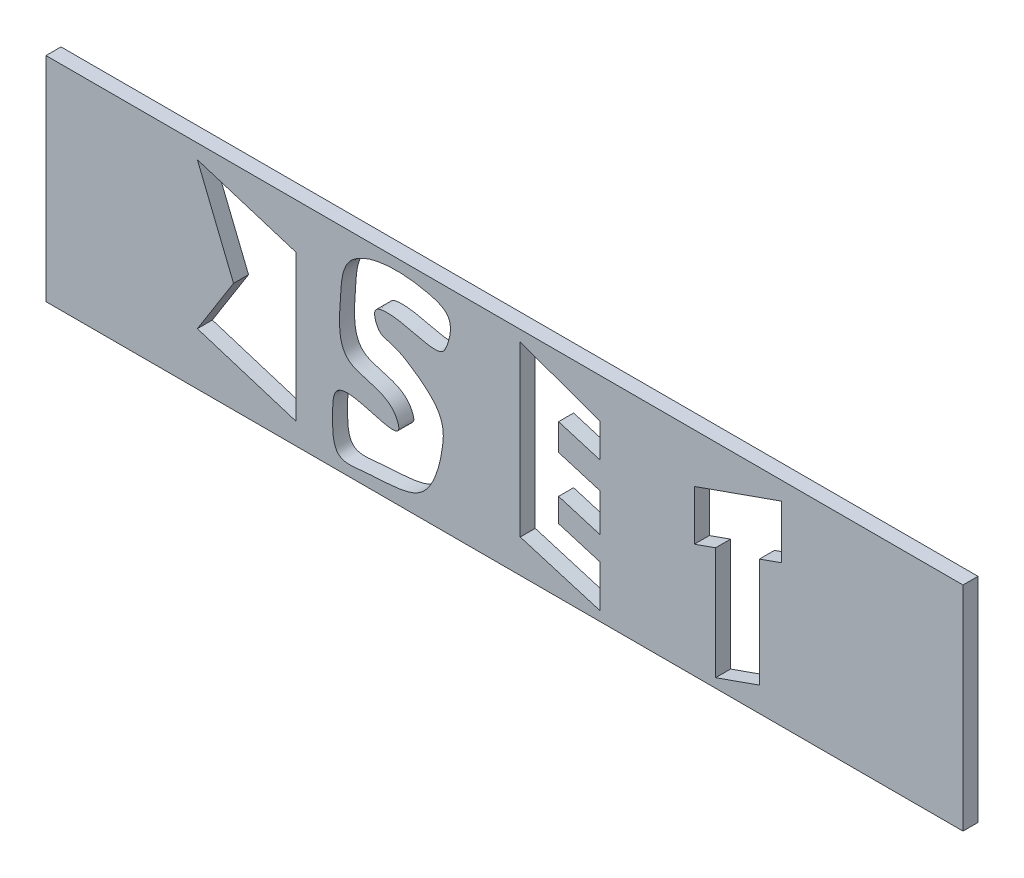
from build123d import *

# Parameters (mm, degrees)
ESQUISSE1_W             = 590
ESQUISSE1_H             = 139
EXTRUSION1_DEPTH        = 9
ESQUISSE2_OUTSIDE_W     = 713.244
ESQUISSE2_OUTSIDE_H     = 262.244
ESQUISSE2_OUTSIDE_W_2   = 550.14
ESQUISSE2_OUTSIDE_H_2   = 127.9
ENL_V_MAT_EXTRU_1_DEPTH = 10


with BuildPart() as part:
    # Esquisse1 → Extrusion1 (new body)
    with BuildSketch(Plane.XY):
        with Locations((295, 69.5)):
            Rectangle(ESQUISSE1_W, ESQUISSE1_H)
        with BuildLine():
            add(Edge.make_bspline(
                [(250.451103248, 122.077203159), (234.576066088, 125.766642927), (209.832006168, 124.794224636), (199.387770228, 110.7545002), (197.001096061, 79.011733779), (195.444091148, 57.859997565), (227.725173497, 58.091697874), (238.71284907, 31.257398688), (193.842474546, 56.988496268), (193.24970193, 28.358053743), (193.414417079, 7.179029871), (221.156842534, 11.881347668), (250.675590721, 9.483557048), (262.105561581, 52.039219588), (259.849385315, 66.244423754), (227.65197606, 87.016413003), (221.79163942, 82.35515121), (217.050632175, 98.634671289), (236.826109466, 101.780458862), (257.137510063, 89.951773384), (262.907018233, 102.013136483), (267.671859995, 116.919735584), (255.998863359, 120.787875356), (250.451103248, 122.077203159)],
                knots=[0, 0, 0, 0, 0.098400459, 0.148759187, 0.148759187, 0.237266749, 0.3015984, 0.317591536, 0.401494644, 0.435731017, 0.482086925, 0.518804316, 0.5990467, 0.669356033, 0.762623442, 0.762623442, 0.81051864, 0.828887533, 0.845072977, 0.926852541, 0.926852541, 0.965612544, 1, 1, 1, 1], degree=3))
        make_face(mode=Mode.SUBTRACT)
        Polygon((112.29, 122.18), (171.59, 103.63), (171.59, 15.82), (112.29, 34.38), (134, 68.79), align=None, mode=Mode.SUBTRACT)
        Polygon((354, 106.92), (306, 124.42), (306, 23), (354, 8.6), (354, 33.92), (329, 41.42), (329, 55.62), (354, 48.12), (354, 70.92), (329, 78.42), (329, 94.42), (354, 86.92), align=None, mode=Mode.SUBTRACT)
        Polygon((410.474193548, 101.5), (462.791397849, 120), (462.791397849, 88), (449.5, 83.3), (449.5, 17.8), (423.2, 8.5), (423.2, 76), (410.474193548, 71.5), align=None, mode=Mode.SUBTRACT)
    extrude(amount=EXTRUSION1_DEPTH)

    # Esquisse2 outside → Enl_v. mat.-Extru.1 (cut)
    with BuildSketch(Plane.XY.offset(9)):
        with Locations((295, 69.5)):
            Rectangle(ESQUISSE2_OUTSIDE_W, ESQUISSE2_OUTSIDE_H)
        with Locations((296.557799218, 66.942473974)):
            Rectangle(ESQUISSE2_OUTSIDE_W_2, ESQUISSE2_OUTSIDE_H_2, mode=Mode.SUBTRACT)
    extrude(amount=-ENL_V_MAT_EXTRU_1_DEPTH, mode=Mode.SUBTRACT)


solid = part.part
